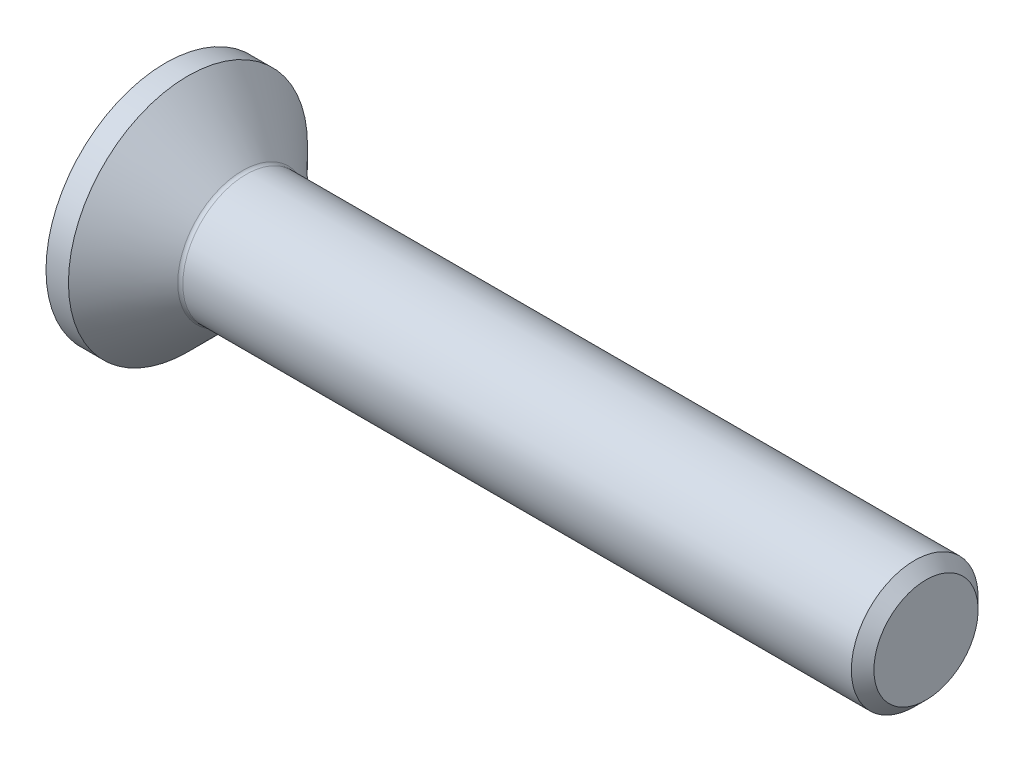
from build123d import *

# Parameters (mm, degrees)
FILLET1_R   = 0.2
HEX_2_DEPTH = 1.9


with BuildPart() as part:
    # BodySke → BaseBody (revolve)
    with BuildSketch(Plane.XY, mode=Mode.PRIVATE) as basebody_sk:
        Polygon((0, 0), (0, 4.715), (0.885, 4.715), (3.1, 2.5), (29.555, 2.5), (30, 2.055), (30, 0), align=None)
    revolve(basebody_sk.sketch.rotate(Axis((0, 0, 0), (1, 0, 0)), 90), axis=Axis((0, 0, 0), (1, 0, 0)))

    # Fillet1
    fillet1_edges = [part.edges().sort_by_distance(p)[0] for p in [
        (3.1, 0, -2.5),
    ]]
    fillet(fillet1_edges, radius=FILLET1_R)

    # Sketch2 → PreBroach (revolve, cut)
    with BuildSketch(Plane.XY, mode=Mode.PRIVATE) as prebroach_sk:
        Polygon((0, 1.5), (1.9, 1.5), (2.766025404, 0), (0, 0), align=None)
    revolve(prebroach_sk.sketch.rotate(Axis((0, 0, 0), (1, 0, 0)), 90), axis=Axis((0, 0, 0), (1, 0, 0)), mode=Mode.SUBTRACT)

    # Sketch3 → Hex 2 (cut)
    with BuildSketch(Plane.ZY):
        Polygon((-1.5, -0.866025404), (-1.5, 0.866025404), (0, 1.732050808), (1.5, 0.866025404), (1.5, -0.866025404), (0, -1.732050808), align=None)
    extrude(amount=-HEX_2_DEPTH, mode=Mode.SUBTRACT)


solid = part.part
